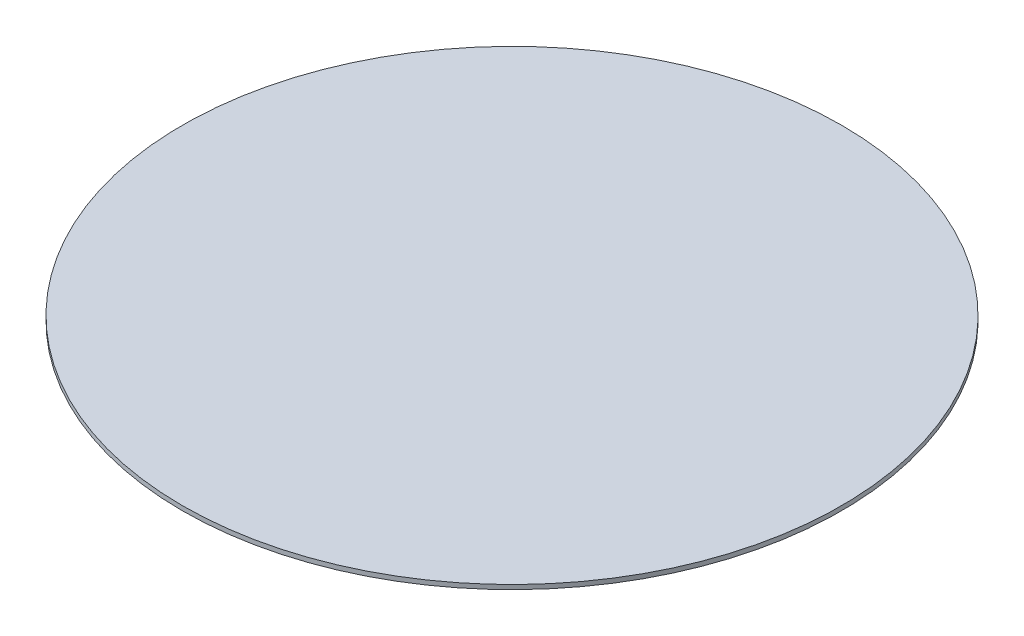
ISO-10303-21;
HEADER;
FILE_DESCRIPTION(('STEP AP214'),'2;1');
FILE_NAME('part.step','',(''),(''),'','','');
FILE_SCHEMA(('AUTOMOTIVE_DESIGN { 1 0 10303 214 1 1 1 1 }'));
ENDSEC;
DATA;
#1=APPLICATION_CONTEXT('core data for automotive mechanical design processes');
#2=APPLICATION_PROTOCOL_DEFINITION('international standard','automotive_design',2000,#1);
#3=PRODUCT_CONTEXT('',#1,'mechanical');
#4=PRODUCT('Part','Part','',(#3));
#5=PRODUCT_RELATED_PRODUCT_CATEGORY('part','',(#4));
#6=PRODUCT_DEFINITION_FORMATION('','',#4);
#7=PRODUCT_DEFINITION_CONTEXT('part definition',#1,'design');
#8=PRODUCT_DEFINITION('design','',#6,#7);
#9=PRODUCT_DEFINITION_SHAPE('','',#8);
#10=(LENGTH_UNIT() NAMED_UNIT(*) SI_UNIT(.MILLI.,.METRE.));
#11=(NAMED_UNIT(*) PLANE_ANGLE_UNIT() SI_UNIT($,.RADIAN.));
#12=(NAMED_UNIT(*) SI_UNIT($,.STERADIAN.) SOLID_ANGLE_UNIT());
#13=UNCERTAINTY_MEASURE_WITH_UNIT(LENGTH_MEASURE(1.E-05),#10,'distance_accuracy_value','');
#14=(GEOMETRIC_REPRESENTATION_CONTEXT(3) GLOBAL_UNCERTAINTY_ASSIGNED_CONTEXT((#13)) GLOBAL_UNIT_ASSIGNED_CONTEXT((#10,
#11,#12)) REPRESENTATION_CONTEXT('',''));
#15=CARTESIAN_POINT('',(0.,0.,0.));
#16=DIRECTION('',(0.,0.,1.));
#17=DIRECTION('',(1.,0.,0.));
#18=AXIS2_PLACEMENT_3D('',#15,#16,#17);
#19=CARTESIAN_POINT('',(0.,2.54,0.));
#20=DIRECTION('',(0.,-1.,0.));
#21=DIRECTION('',(0.,0.,-1.));
#22=AXIS2_PLACEMENT_3D('',#19,#20,#21);
#23=CYLINDRICAL_SURFACE('',#22,187.96);
#24=CARTESIAN_POINT('',(0.,2.54,0.));
#25=DIRECTION('',(0.,1.,0.));
#26=DIRECTION('',(0.,0.,1.));
#27=AXIS2_PLACEMENT_3D('',#24,#25,#26);
#28=CIRCLE('',#27,187.96);
#29=CARTESIAN_POINT('',(0.,2.54,187.96));
#30=VERTEX_POINT('',#29);
#31=EDGE_CURVE('E10',#30,#30,#28,.T.);
#32=ORIENTED_EDGE('',*,*,#31,.F.);
#33=EDGE_LOOP('',(#32));
#34=FACE_BOUND('',#33,.T.);
#35=CARTESIAN_POINT('',(0.,0.,0.));
#36=DIRECTION('',(0.,1.,0.));
#37=DIRECTION('',(0.,0.,1.));
#38=AXIS2_PLACEMENT_3D('',#35,#36,#37);
#39=CIRCLE('',#38,187.96);
#40=CARTESIAN_POINT('',(0.,0.,187.96));
#41=VERTEX_POINT('',#40);
#42=EDGE_CURVE('E39',#41,#41,#39,.T.);
#43=ORIENTED_EDGE('',*,*,#42,.T.);
#44=EDGE_LOOP('',(#43));
#45=FACE_BOUND('',#44,.T.);
#46=ADVANCED_FACE('F36',(#34,#45),#23,.T.);
#47=CARTESIAN_POINT('',(0.,2.54,0.));
#48=DIRECTION('',(0.,1.,0.));
#49=DIRECTION('',(0.,0.,1.));
#50=AXIS2_PLACEMENT_3D('',#47,#48,#49);
#51=PLANE('',#50);
#52=ORIENTED_EDGE('',*,*,#31,.T.);
#53=EDGE_LOOP('',(#52));
#54=FACE_BOUND('',#53,.T.);
#55=ADVANCED_FACE('F53',(#54),#51,.T.);
#56=CARTESIAN_POINT('',(0.,0.,0.));
#57=DIRECTION('',(0.,1.,0.));
#58=DIRECTION('',(0.,0.,1.));
#59=AXIS2_PLACEMENT_3D('',#56,#57,#58);
#60=PLANE('',#59);
#61=ORIENTED_EDGE('',*,*,#42,.F.);
#62=EDGE_LOOP('',(#61));
#63=FACE_BOUND('',#62,.T.);
#64=ADVANCED_FACE('F51',(#63),#60,.F.);
#65=CLOSED_SHELL('',(#46,#55,#64));
#66=MANIFOLD_SOLID_BREP('B2',#65);
#67=ADVANCED_BREP_SHAPE_REPRESENTATION('',(#18,#66),#14);
#68=SHAPE_DEFINITION_REPRESENTATION(#9,#67);
ENDSEC;
END-ISO-10303-21;
